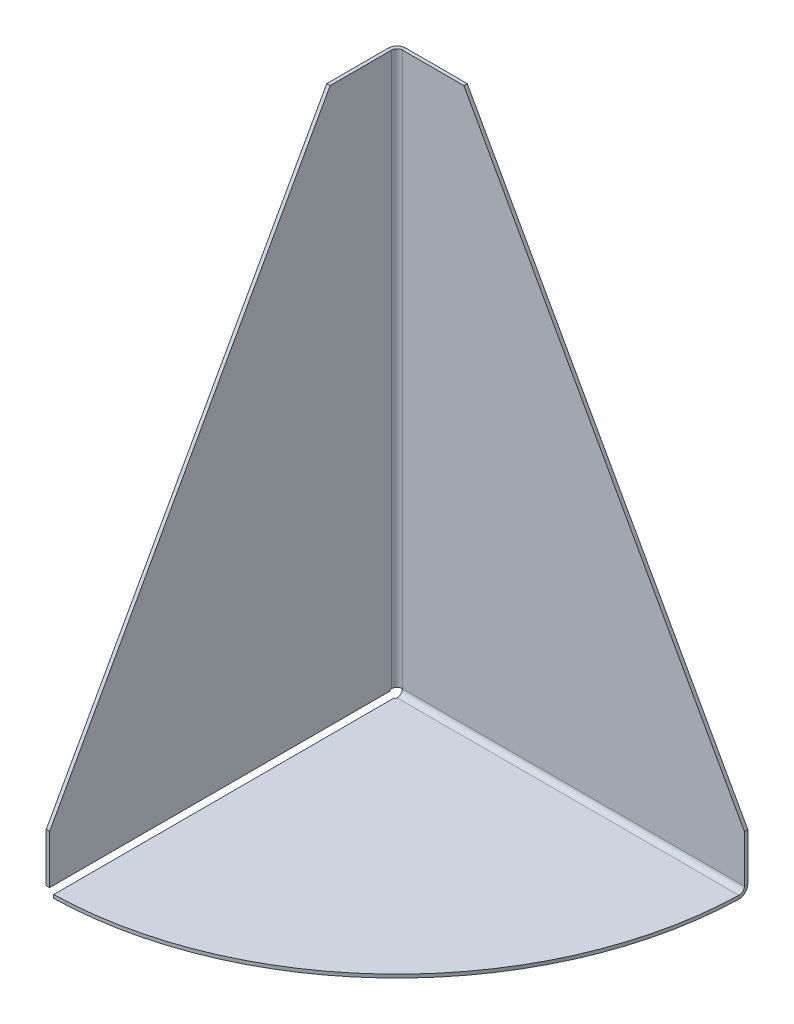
ISO-10303-21;
HEADER;
FILE_DESCRIPTION(('STEP AP214'),'2;1');
FILE_NAME('part.step','',(''),(''),'','','');
FILE_SCHEMA(('AUTOMOTIVE_DESIGN { 1 0 10303 214 1 1 1 1 }'));
ENDSEC;
DATA;
#1=APPLICATION_CONTEXT('core data for automotive mechanical design processes');
#2=APPLICATION_PROTOCOL_DEFINITION('international standard','automotive_design',2000,#1);
#3=PRODUCT_CONTEXT('',#1,'mechanical');
#4=PRODUCT('Part','Part','',(#3));
#5=PRODUCT_RELATED_PRODUCT_CATEGORY('part','',(#4));
#6=PRODUCT_DEFINITION_FORMATION('','',#4);
#7=PRODUCT_DEFINITION_CONTEXT('part definition',#1,'design');
#8=PRODUCT_DEFINITION('design','',#6,#7);
#9=PRODUCT_DEFINITION_SHAPE('','',#8);
#10=(LENGTH_UNIT() NAMED_UNIT(*) SI_UNIT(.MILLI.,.METRE.));
#11=(NAMED_UNIT(*) PLANE_ANGLE_UNIT() SI_UNIT($,.RADIAN.));
#12=(NAMED_UNIT(*) SI_UNIT($,.STERADIAN.) SOLID_ANGLE_UNIT());
#13=UNCERTAINTY_MEASURE_WITH_UNIT(LENGTH_MEASURE(1.E-05),#10,'distance_accuracy_value','');
#14=(GEOMETRIC_REPRESENTATION_CONTEXT(3) GLOBAL_UNCERTAINTY_ASSIGNED_CONTEXT((#13)) GLOBAL_UNIT_ASSIGNED_CONTEXT((#10,
#11,#12)) REPRESENTATION_CONTEXT('',''));
#15=CARTESIAN_POINT('',(0.,0.,0.));
#16=DIRECTION('',(0.,0.,1.));
#17=DIRECTION('',(1.,0.,0.));
#18=AXIS2_PLACEMENT_3D('',#15,#16,#17);
#19=CARTESIAN_POINT('',(3.11911999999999,3.11911999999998,3.11912));
#20=DIRECTION('',(0.,-1.,0.));
#21=DIRECTION('',(0.,0.,-1.));
#22=AXIS2_PLACEMENT_3D('',#19,#20,#21);
#23=PLANE('',#22);
#24=DIRECTION('',(0.,0.,-1.));
#25=VECTOR('',#24,1.);
#26=CARTESIAN_POINT('',(3.11911999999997,3.11911999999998,0.));
#27=LINE('',#26,#25);
#28=CARTESIAN_POINT('',(3.11911999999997,3.11911999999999,1.21412));
#29=VERTEX_POINT('',#28);
#30=CARTESIAN_POINT('',(3.11911999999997,3.11911999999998,0.));
#31=VERTEX_POINT('',#30);
#32=EDGE_CURVE('E11',#29,#31,#27,.T.);
#33=ORIENTED_EDGE('',*,*,#32,.F.);
#34=CARTESIAN_POINT('',(3.11911999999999,3.11911999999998,3.11912));
#35=DIRECTION('',(0.,1.,0.));
#36=DIRECTION('',(0.,0.,1.));
#37=AXIS2_PLACEMENT_3D('',#34,#35,#36);
#38=CIRCLE('',#37,1.905);
#39=CARTESIAN_POINT('',(1.21411999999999,3.11911999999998,3.11911999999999));
#40=VERTEX_POINT('',#39);
#41=EDGE_CURVE('E113',#29,#40,#38,.T.);
#42=ORIENTED_EDGE('',*,*,#41,.T.);
#43=DIRECTION('',(-1.,0.,0.));
#44=VECTOR('',#43,1.);
#45=CARTESIAN_POINT('',(0.,3.11911999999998,3.11911999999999));
#46=LINE('',#45,#44);
#47=CARTESIAN_POINT('',(0.,3.11911999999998,3.11911999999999));
#48=VERTEX_POINT('',#47);
#49=EDGE_CURVE('E46',#40,#48,#46,.T.);
#50=ORIENTED_EDGE('',*,*,#49,.T.);
#51=CARTESIAN_POINT('',(3.11911999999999,3.11911999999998,3.11912));
#52=DIRECTION('',(0.,1.,0.));
#53=DIRECTION('',(0.,0.,1.));
#54=AXIS2_PLACEMENT_3D('',#51,#52,#53);
#55=CIRCLE('',#54,3.11912);
#56=EDGE_CURVE('E116',#31,#48,#55,.T.);
#57=ORIENTED_EDGE('',*,*,#56,.F.);
#58=EDGE_LOOP('',(#33,#42,#50,#57));
#59=FACE_BOUND('',#58,.T.);
#60=ADVANCED_FACE('F36',(#59),#23,.T.);
#61=CARTESIAN_POINT('',(0.,3.11911999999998,0.));
#62=DIRECTION('',(0.,1.,0.));
#63=DIRECTION('',(0.,0.,1.));
#64=AXIS2_PLACEMENT_3D('',#61,#62,#63);
#65=PLANE('',#64);
#66=ORIENTED_EDGE('',*,*,#49,.F.);
#67=DIRECTION('',(0.,0.,-1.));
#68=VECTOR('',#67,1.);
#69=CARTESIAN_POINT('',(1.21412,3.11911999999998,0.));
#70=LINE('',#69,#68);
#71=CARTESIAN_POINT('',(1.21411999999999,3.11911999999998,3.716490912));
#72=VERTEX_POINT('',#71);
#73=EDGE_CURVE('E257',#40,#72,#70,.F.);
#74=ORIENTED_EDGE('',*,*,#73,.T.);
#75=DIRECTION('',(-1.,0.,0.));
#76=VECTOR('',#75,1.);
#77=CARTESIAN_POINT('',(0.,3.11911999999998,3.716490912));
#78=LINE('',#77,#76);
#79=CARTESIAN_POINT('',(0.,3.11911999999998,3.716490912));
#80=VERTEX_POINT('',#79);
#81=EDGE_CURVE('E390',#72,#80,#78,.T.);
#82=ORIENTED_EDGE('',*,*,#81,.T.);
#83=DIRECTION('',(0.,0.,1.));
#84=VECTOR('',#83,1.);
#85=CARTESIAN_POINT('',(0.,3.11911999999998,0.));
#86=LINE('',#85,#84);
#87=EDGE_CURVE('E402',#48,#80,#86,.T.);
#88=ORIENTED_EDGE('',*,*,#87,.F.);
#89=EDGE_LOOP('',(#66,#74,#82,#88));
#90=FACE_BOUND('',#89,.T.);
#91=ADVANCED_FACE('F403',(#90),#65,.F.);
#92=CARTESIAN_POINT('',(0.,0.,3.716490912));
#93=DIRECTION('',(0.,0.,-1.));
#94=DIRECTION('',(0.,1.,0.));
#95=AXIS2_PLACEMENT_3D('',#92,#93,#94);
#96=PLANE('',#95);
#97=ORIENTED_EDGE('',*,*,#81,.F.);
#98=DIRECTION('',(0.,1.,0.));
#99=VECTOR('',#98,1.);
#100=CARTESIAN_POINT('',(1.21411999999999,0.,3.716490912));
#101=LINE('',#100,#99);
#102=CARTESIAN_POINT('',(1.21411999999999,2.6283335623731,3.716490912));
#103=VERTEX_POINT('',#102);
#104=EDGE_CURVE('E255',#103,#72,#101,.T.);
#105=ORIENTED_EDGE('',*,*,#104,.F.);
#106=DIRECTION('',(-1.,0.,0.));
#107=VECTOR('',#106,1.);
#108=CARTESIAN_POINT('',(0.,2.6283335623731,3.716490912));
#109=LINE('',#108,#107);
#110=CARTESIAN_POINT('',(0.,2.6283335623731,3.716490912));
#111=VERTEX_POINT('',#110);
#112=EDGE_CURVE('E387',#103,#111,#109,.T.);
#113=ORIENTED_EDGE('',*,*,#112,.T.);
#114=DIRECTION('',(0.,1.,0.));
#115=VECTOR('',#114,1.);
#116=CARTESIAN_POINT('',(0.,0.,3.716490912));
#117=LINE('',#116,#115);
#118=EDGE_CURVE('E408',#111,#80,#117,.T.);
#119=ORIENTED_EDGE('',*,*,#118,.T.);
#120=EDGE_LOOP('',(#97,#105,#113,#119));
#121=FACE_BOUND('',#120,.T.);
#122=ADVANCED_FACE('F488',(#121),#96,.T.);
#123=CARTESIAN_POINT('',(0.,2.6283335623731,0.));
#124=DIRECTION('',(0.,1.,0.));
#125=DIRECTION('',(0.,0.,1.));
#126=AXIS2_PLACEMENT_3D('',#123,#124,#125);
#127=PLANE('',#126);
#128=ORIENTED_EDGE('',*,*,#112,.F.);
#129=DIRECTION('',(0.,0.,-1.));
#130=VECTOR('',#129,1.);
#131=CARTESIAN_POINT('',(1.21412,2.6283335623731,0.));
#132=LINE('',#131,#130);
#133=CARTESIAN_POINT('',(1.21411999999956,2.6283335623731,124.879785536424));
#134=VERTEX_POINT('',#133);
#135=EDGE_CURVE('E176',#103,#134,#132,.F.);
#136=ORIENTED_EDGE('',*,*,#135,.T.);
#137=DIRECTION('',(-1.,0.,0.));
#138=VECTOR('',#137,1.);
#139=CARTESIAN_POINT('',(-4.36015440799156E-13,2.6283335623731,124.879785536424));
#140=LINE('',#139,#138);
#141=CARTESIAN_POINT('',(-4.36015440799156E-13,2.6283335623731,124.879785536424));
#142=VERTEX_POINT('',#141);
#143=EDGE_CURVE('E384',#134,#142,#140,.T.);
#144=ORIENTED_EDGE('',*,*,#143,.T.);
#145=DIRECTION('',(0.,0.,1.));
#146=VECTOR('',#145,1.);
#147=CARTESIAN_POINT('',(0.,2.6283335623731,0.));
#148=LINE('',#147,#146);
#149=EDGE_CURVE('E187',#111,#142,#148,.T.);
#150=ORIENTED_EDGE('',*,*,#149,.F.);
#151=EDGE_LOOP('',(#128,#136,#144,#150));
#152=FACE_BOUND('',#151,.T.);
#153=ADVANCED_FACE('F493',(#152),#127,.F.);
#154=CARTESIAN_POINT('',(-4.36015440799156E-13,0.,124.879785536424));
#155=DIRECTION('',(0.,0.,-1.));
#156=DIRECTION('',(0.,1.,0.));
#157=AXIS2_PLACEMENT_3D('',#154,#155,#156);
#158=PLANE('',#157);
#159=ORIENTED_EDGE('',*,*,#143,.F.);
#160=DIRECTION('',(0.,1.,0.));
#161=VECTOR('',#160,1.);
#162=CARTESIAN_POINT('',(1.21411999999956,0.,124.879785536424));
#163=LINE('',#162,#161);
#164=CARTESIAN_POINT('',(1.21411999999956,20.,124.879785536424));
#165=VERTEX_POINT('',#164);
#166=EDGE_CURVE('E160',#134,#165,#163,.T.);
#167=ORIENTED_EDGE('',*,*,#166,.T.);
#168=DIRECTION('',(-1.,0.,0.));
#169=VECTOR('',#168,1.);
#170=CARTESIAN_POINT('',(-4.36015440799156E-13,20.,124.879785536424));
#171=LINE('',#170,#169);
#172=CARTESIAN_POINT('',(-4.36015440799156E-13,20.,124.879785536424));
#173=VERTEX_POINT('',#172);
#174=EDGE_CURVE('E381',#165,#173,#171,.T.);
#175=ORIENTED_EDGE('',*,*,#174,.T.);
#176=DIRECTION('',(0.,1.,0.));
#177=VECTOR('',#176,1.);
#178=CARTESIAN_POINT('',(-4.36015440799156E-13,0.,124.879785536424));
#179=LINE('',#178,#177);
#180=EDGE_CURVE('E422',#142,#173,#179,.T.);
#181=ORIENTED_EDGE('',*,*,#180,.F.);
#182=EDGE_LOOP('',(#159,#167,#175,#181));
#183=FACE_BOUND('',#182,.T.);
#184=ADVANCED_FACE('F462',(#183),#158,.F.);
#185=CARTESIAN_POINT('',(0.,200.,25.));
#186=DIRECTION('',(0.,-0.485196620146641,-0.874405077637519));
#187=DIRECTION('',(0.,0.874405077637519,-0.485196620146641));
#188=AXIS2_PLACEMENT_3D('',#185,#186,#187);
#189=PLANE('',#188);
#190=ORIENTED_EDGE('',*,*,#174,.F.);
#191=DIRECTION('',(0.,0.874405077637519,-0.485196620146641));
#192=VECTOR('',#191,1.);
#193=CARTESIAN_POINT('',(1.21411999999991,200.,25.));
#194=LINE('',#193,#192);
#195=CARTESIAN_POINT('',(1.21411999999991,200.,25.));
#196=VERTEX_POINT('',#195);
#197=EDGE_CURVE('E163',#165,#196,#194,.T.);
#198=ORIENTED_EDGE('',*,*,#197,.T.);
#199=DIRECTION('',(-1.,0.,0.));
#200=VECTOR('',#199,1.);
#201=CARTESIAN_POINT('',(0.,200.,25.));
#202=LINE('',#201,#200);
#203=CARTESIAN_POINT('',(0.,200.,25.));
#204=VERTEX_POINT('',#203);
#205=EDGE_CURVE('E378',#196,#204,#202,.T.);
#206=ORIENTED_EDGE('',*,*,#205,.T.);
#207=DIRECTION('',(0.,0.874405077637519,-0.485196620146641));
#208=VECTOR('',#207,1.);
#209=CARTESIAN_POINT('',(0.,200.,25.));
#210=LINE('',#209,#208);
#211=EDGE_CURVE('E424',#173,#204,#210,.T.);
#212=ORIENTED_EDGE('',*,*,#211,.F.);
#213=EDGE_LOOP('',(#190,#198,#206,#212));
#214=FACE_BOUND('',#213,.T.);
#215=ADVANCED_FACE('F466',(#214),#189,.F.);
#216=CARTESIAN_POINT('',(0.,200.,0.));
#217=DIRECTION('',(0.,-1.,0.));
#218=DIRECTION('',(0.,0.,-1.));
#219=AXIS2_PLACEMENT_3D('',#216,#217,#218);
#220=PLANE('',#219);
#221=ORIENTED_EDGE('',*,*,#205,.F.);
#222=DIRECTION('',(0.,0.,-1.));
#223=VECTOR('',#222,1.);
#224=CARTESIAN_POINT('',(1.21412,200.,0.));
#225=LINE('',#224,#223);
#226=CARTESIAN_POINT('',(1.21411999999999,200.,3.11911999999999));
#227=VERTEX_POINT('',#226);
#228=EDGE_CURVE('E246',#196,#227,#225,.T.);
#229=ORIENTED_EDGE('',*,*,#228,.T.);
#230=DIRECTION('',(-1.,0.,0.));
#231=VECTOR('',#230,1.);
#232=CARTESIAN_POINT('',(0.,200.,3.11911999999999));
#233=LINE('',#232,#231);
#234=CARTESIAN_POINT('',(0.,200.,3.11911999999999));
#235=VERTEX_POINT('',#234);
#236=EDGE_CURVE('E376',#227,#235,#233,.T.);
#237=ORIENTED_EDGE('',*,*,#236,.T.);
#238=DIRECTION('',(0.,0.,-1.));
#239=VECTOR('',#238,1.);
#240=CARTESIAN_POINT('',(0.,200.,0.));
#241=LINE('',#240,#239);
#242=EDGE_CURVE('E413',#204,#235,#241,.T.);
#243=ORIENTED_EDGE('',*,*,#242,.F.);
#244=EDGE_LOOP('',(#221,#229,#237,#243));
#245=FACE_BOUND('',#244,.T.);
#246=ADVANCED_FACE('F471',(#245),#220,.F.);
#247=CARTESIAN_POINT('',(3.11911999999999,200.,3.11912));
#248=DIRECTION('',(0.,1.,0.));
#249=DIRECTION('',(0.,0.,1.));
#250=AXIS2_PLACEMENT_3D('',#247,#248,#249);
#251=PLANE('',#250);
#252=ORIENTED_EDGE('',*,*,#236,.F.);
#253=CARTESIAN_POINT('',(3.11911999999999,200.,3.11912));
#254=DIRECTION('',(0.,1.,0.));
#255=DIRECTION('',(0.,0.,1.));
#256=AXIS2_PLACEMENT_3D('',#253,#254,#255);
#257=CIRCLE('',#256,1.905);
#258=CARTESIAN_POINT('',(3.11911999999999,200.,1.21412));
#259=VERTEX_POINT('',#258);
#260=EDGE_CURVE('E155',#227,#259,#257,.F.);
#261=ORIENTED_EDGE('',*,*,#260,.T.);
#262=DIRECTION('',(0.,0.,-1.));
#263=VECTOR('',#262,1.);
#264=CARTESIAN_POINT('',(3.11911999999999,200.,0.));
#265=LINE('',#264,#263);
#266=CARTESIAN_POINT('',(3.11911999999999,200.,0.));
#267=VERTEX_POINT('',#266);
#268=EDGE_CURVE('E54',#259,#267,#265,.T.);
#269=ORIENTED_EDGE('',*,*,#268,.T.);
#270=CARTESIAN_POINT('',(3.11911999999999,200.,3.11912));
#271=DIRECTION('',(0.,-1.,0.));
#272=DIRECTION('',(0.,0.,-1.));
#273=AXIS2_PLACEMENT_3D('',#270,#271,#272);
#274=CIRCLE('',#273,3.11912);
#275=EDGE_CURVE('E399',#235,#267,#274,.T.);
#276=ORIENTED_EDGE('',*,*,#275,.F.);
#277=EDGE_LOOP('',(#252,#261,#269,#276));
#278=FACE_BOUND('',#277,.T.);
#279=ADVANCED_FACE('F472',(#278),#251,.T.);
#280=CARTESIAN_POINT('',(0.,200.,0.));
#281=DIRECTION('',(0.,-1.,0.));
#282=DIRECTION('',(-1.,0.,0.));
#283=AXIS2_PLACEMENT_3D('',#280,#281,#282);
#284=PLANE('',#283);
#285=ORIENTED_EDGE('',*,*,#268,.F.);
#286=DIRECTION('',(-1.,0.,0.));
#287=VECTOR('',#286,1.);
#288=CARTESIAN_POINT('',(0.,200.,1.21412));
#289=LINE('',#288,#287);
#290=CARTESIAN_POINT('',(25.,200.,1.21412));
#291=VERTEX_POINT('',#290);
#292=EDGE_CURVE('E134',#291,#259,#289,.T.);
#293=ORIENTED_EDGE('',*,*,#292,.F.);
#294=DIRECTION('',(0.,0.,-1.));
#295=VECTOR('',#294,1.);
#296=CARTESIAN_POINT('',(25.,200.,0.));
#297=LINE('',#296,#295);
#298=CARTESIAN_POINT('',(25.,200.,0.));
#299=VERTEX_POINT('',#298);
#300=EDGE_CURVE('E372',#291,#299,#297,.T.);
#301=ORIENTED_EDGE('',*,*,#300,.T.);
#302=DIRECTION('',(-1.,0.,0.));
#303=VECTOR('',#302,1.);
#304=CARTESIAN_POINT('',(0.,200.,0.));
#305=LINE('',#304,#303);
#306=EDGE_CURVE('E432',#299,#267,#305,.T.);
#307=ORIENTED_EDGE('',*,*,#306,.T.);
#308=EDGE_LOOP('',(#285,#293,#301,#307));
#309=FACE_BOUND('',#308,.T.);
#310=ADVANCED_FACE('F474',(#309),#284,.F.);
#311=CARTESIAN_POINT('',(25.,200.,0.));
#312=DIRECTION('',(-0.874405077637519,-0.485196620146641,0.));
#313=DIRECTION('',(-0.485196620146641,0.874405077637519,0.));
#314=AXIS2_PLACEMENT_3D('',#311,#312,#313);
#315=PLANE('',#314);
#316=ORIENTED_EDGE('',*,*,#300,.F.);
#317=DIRECTION('',(-0.485196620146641,0.874405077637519,0.));
#318=VECTOR('',#317,1.);
#319=CARTESIAN_POINT('',(25.,200.,1.21412));
#320=LINE('',#319,#318);
#321=CARTESIAN_POINT('',(124.879785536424,20.,1.21412));
#322=VERTEX_POINT('',#321);
#323=EDGE_CURVE('E181',#322,#291,#320,.T.);
#324=ORIENTED_EDGE('',*,*,#323,.F.);
#325=DIRECTION('',(0.,0.,-1.));
#326=VECTOR('',#325,1.);
#327=CARTESIAN_POINT('',(124.879785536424,20.,0.));
#328=LINE('',#327,#326);
#329=CARTESIAN_POINT('',(124.879785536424,20.,0.));
#330=VERTEX_POINT('',#329);
#331=EDGE_CURVE('E358',#322,#330,#328,.T.);
#332=ORIENTED_EDGE('',*,*,#331,.T.);
#333=DIRECTION('',(-0.485196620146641,0.874405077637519,0.));
#334=VECTOR('',#333,1.);
#335=CARTESIAN_POINT('',(25.,200.,0.));
#336=LINE('',#335,#334);
#337=EDGE_CURVE('E434',#330,#299,#336,.T.);
#338=ORIENTED_EDGE('',*,*,#337,.T.);
#339=EDGE_LOOP('',(#316,#324,#332,#338));
#340=FACE_BOUND('',#339,.T.);
#341=ADVANCED_FACE('F480',(#340),#315,.F.);
#342=CARTESIAN_POINT('',(124.879785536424,0.,0.));
#343=DIRECTION('',(-1.,0.,0.));
#344=DIRECTION('',(0.,1.,0.));
#345=AXIS2_PLACEMENT_3D('',#342,#343,#344);
#346=PLANE('',#345);
#347=ORIENTED_EDGE('',*,*,#331,.F.);
#348=DIRECTION('',(0.,1.,0.));
#349=VECTOR('',#348,1.);
#350=CARTESIAN_POINT('',(124.879785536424,0.,1.21412));
#351=LINE('',#350,#349);
#352=CARTESIAN_POINT('',(124.879785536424,3.11912,1.21412));
#353=VERTEX_POINT('',#352);
#354=EDGE_CURVE('E177',#353,#322,#351,.T.);
#355=ORIENTED_EDGE('',*,*,#354,.F.);
#356=CARTESIAN_POINT('',(124.879785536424,3.11912,0.));
#357=CARTESIAN_POINT('',(124.879785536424,3.11912,1.21412));
#358=B_SPLINE_CURVE_WITH_KNOTS('',1,(#356,#357),.UNSPECIFIED.,.F.,.F.,(2,2),(0.,1.),.UNSPECIFIED.);
#359=CARTESIAN_POINT('',(124.879785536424,3.11912,0.));
#360=VERTEX_POINT('',#359);
#361=EDGE_CURVE('E290',#353,#360,#358,.F.);
#362=ORIENTED_EDGE('',*,*,#361,.T.);
#363=DIRECTION('',(0.,1.,0.));
#364=VECTOR('',#363,1.);
#365=CARTESIAN_POINT('',(124.879785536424,0.,0.));
#366=LINE('',#365,#364);
#367=EDGE_CURVE('E188',#360,#330,#366,.T.);
#368=ORIENTED_EDGE('',*,*,#367,.T.);
#369=EDGE_LOOP('',(#347,#355,#362,#368));
#370=FACE_BOUND('',#369,.T.);
#371=ADVANCED_FACE('F325',(#370),#346,.F.);
#372=CARTESIAN_POINT('',(124.840826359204,0.,3.11912));
#373=CARTESIAN_POINT('',(124.84597027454,0.,2.9132380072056));
#374=CARTESIAN_POINT('',(124.850519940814,0.0201868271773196,2.71075566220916));
#375=CARTESIAN_POINT('',(124.856530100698,0.0795192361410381,2.41198038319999));
#376=CARTESIAN_POINT('',(124.858397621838,0.104174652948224,2.31321631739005));
#377=CARTESIAN_POINT('',(124.861872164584,0.163464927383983,2.11738186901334));
#378=CARTESIAN_POINT('',(124.863482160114,0.198268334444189,2.02004202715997));
#379=CARTESIAN_POINT('',(124.867849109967,0.31553992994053,1.73687637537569));
#380=CARTESIAN_POINT('',(124.870183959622,0.411230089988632,1.55779294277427));
#381=CARTESIAN_POINT('',(124.873952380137,0.637314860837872,1.21884286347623));
#382=CARTESIAN_POINT('',(124.875383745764,0.768921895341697,1.0583333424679));
#383=CARTESIAN_POINT('',(124.877490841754,1.0564271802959,0.770594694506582));
#384=CARTESIAN_POINT('',(124.878190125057,1.21330424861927,0.641462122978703));
#385=CARTESIAN_POINT('',(124.879153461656,1.55392691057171,0.413368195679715));
#386=CARTESIAN_POINT('',(124.879409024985,1.73534848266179,0.316387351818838));
#387=CARTESIAN_POINT('',(124.879855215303,2.29788323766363,0.0827772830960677));
#388=CARTESIAN_POINT('',(124.879785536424,2.70876689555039,0.));
#389=CARTESIAN_POINT('',(124.879785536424,3.11912,0.));
#390=CARTESIAN_POINT('',(124.840826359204,1.21412,3.11912));
#391=CARTESIAN_POINT('',(124.845970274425,1.21412,2.99337774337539));
#392=CARTESIAN_POINT('',(124.850519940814,1.22644908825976,2.86971181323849));
#393=CARTESIAN_POINT('',(124.856530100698,1.26268630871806,2.68723505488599));
#394=CARTESIAN_POINT('',(124.858397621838,1.27774458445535,2.62691498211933));
#395=CARTESIAN_POINT('',(124.861872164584,1.31395607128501,2.50730925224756));
#396=CARTESIAN_POINT('',(124.863482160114,1.33521222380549,2.44785902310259));
#397=CARTESIAN_POINT('',(124.867849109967,1.40683575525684,2.27491583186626));
#398=CARTESIAN_POINT('',(124.870183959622,1.46527844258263,2.16554077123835));
#399=CARTESIAN_POINT('',(124.873952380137,1.60335953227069,1.95852728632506));
#400=CARTESIAN_POINT('',(124.875383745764,1.68373842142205,1.8604962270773));
#401=CARTESIAN_POINT('',(124.877490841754,1.859332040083,1.68476008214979));
#402=CARTESIAN_POINT('',(124.878190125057,1.95514458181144,1.60589246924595));
#403=CARTESIAN_POINT('',(124.879153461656,2.16317959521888,1.46658428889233));
#404=CARTESIAN_POINT('',(124.879409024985,2.27398267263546,1.40735331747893));
#405=CARTESIAN_POINT('',(124.879855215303,2.61755031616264,1.26467615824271));
#406=CARTESIAN_POINT('',(124.879785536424,2.86849717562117,1.21412));
#407=CARTESIAN_POINT('',(124.879785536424,3.11912,1.21412));
#408=B_SPLINE_SURFACE_WITH_KNOTS('',1,3,((#372,#373,#374,#375,#376,#377,#378,#379,#380,#381,
#382,#383,#384,#385,#386,#387,#388,#389),(#390,#391,#392,#393,#394,#395,#396,#397,#398,#399,
#400,#401,#402,#403,#404,#405,#406,#407)),.UNSPECIFIED.,.F.,.F.,.F.,(2,2),(4,2,2,2,2,2,2,2,4),
(0.,1.),(0.,0.0006091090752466,0.0009136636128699,0.0012182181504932,0.0018273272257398,
0.0024364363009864,0.003045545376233,0.0036546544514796,0.0048728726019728),.UNSPECIFIED.);
#409=CARTESIAN_POINT('',(124.879785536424,3.11912,1.21412));
#410=CARTESIAN_POINT('',(124.879785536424,2.86849717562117,1.21412));
#411=CARTESIAN_POINT('',(124.879855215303,2.61755031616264,1.26467615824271));
#412=CARTESIAN_POINT('',(124.879409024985,2.27398267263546,1.40735331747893));
#413=CARTESIAN_POINT('',(124.879153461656,2.16317959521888,1.46658428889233));
#414=CARTESIAN_POINT('',(124.878190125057,1.95514458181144,1.60589246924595));
#415=CARTESIAN_POINT('',(124.877490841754,1.859332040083,1.68476008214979));
#416=CARTESIAN_POINT('',(124.875383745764,1.68373842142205,1.8604962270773));
#417=CARTESIAN_POINT('',(124.873952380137,1.60335953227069,1.95852728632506));
#418=CARTESIAN_POINT('',(124.870183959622,1.46527844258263,2.16554077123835));
#419=CARTESIAN_POINT('',(124.867849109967,1.40683575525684,2.27491583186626));
#420=CARTESIAN_POINT('',(124.863482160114,1.33521222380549,2.44785902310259));
#421=CARTESIAN_POINT('',(124.861872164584,1.31395607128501,2.50730925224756));
#422=CARTESIAN_POINT('',(124.858397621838,1.27774458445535,2.62691498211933));
#423=CARTESIAN_POINT('',(124.856530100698,1.26268630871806,2.68723505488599));
#424=CARTESIAN_POINT('',(124.850519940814,1.22644908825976,2.86971181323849));
#425=CARTESIAN_POINT('',(124.845970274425,1.21412,2.99337774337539));
#426=CARTESIAN_POINT('',(124.840826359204,1.21412,3.11912));
#427=B_SPLINE_CURVE_WITH_KNOTS('',3,(#409,#410,#411,#412,#413,#414,#415,#416,#417,#418,#419,
#420,#421,#422,#423,#424,#425,#426),.UNSPECIFIED.,.F.,.F.,(4,2,2,2,2,2,2,2,4),(0.,
0.0012182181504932,0.0018273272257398,0.0024364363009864,0.003045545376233,0.0036546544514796,
0.0039592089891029,0.0042637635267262,0.0048728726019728),.UNSPECIFIED.);
#428=CARTESIAN_POINT('',(124.840826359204,1.21412,3.11912));
#429=VERTEX_POINT('',#428);
#430=EDGE_CURVE('E146',#353,#429,#427,.T.);
#431=CARTESIAN_POINT('',(124.840826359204,1.21412,3.11912));
#432=CARTESIAN_POINT('',(124.840826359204,0.,3.11912));
#433=B_SPLINE_CURVE_WITH_KNOTS('',1,(#431,#432),.UNSPECIFIED.,.F.,.F.,(2,2),(0.,1.),.UNSPECIFIED.);
#434=CARTESIAN_POINT('',(124.840826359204,0.,3.11912));
#435=VERTEX_POINT('',#434);
#436=EDGE_CURVE('E286',#429,#435,#433,.T.);
#437=CARTESIAN_POINT('',(124.840826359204,0.,3.11912));
#438=CARTESIAN_POINT('',(124.84597027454,0.,2.9132380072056));
#439=CARTESIAN_POINT('',(124.850519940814,0.0201868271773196,2.71075566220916));
#440=CARTESIAN_POINT('',(124.856530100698,0.0795192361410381,2.41198038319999));
#441=CARTESIAN_POINT('',(124.858397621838,0.104174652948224,2.31321631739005));
#442=CARTESIAN_POINT('',(124.861872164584,0.163464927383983,2.11738186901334));
#443=CARTESIAN_POINT('',(124.863482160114,0.198268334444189,2.02004202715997));
#444=CARTESIAN_POINT('',(124.867849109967,0.31553992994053,1.73687637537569));
#445=CARTESIAN_POINT('',(124.870183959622,0.411230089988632,1.55779294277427));
#446=CARTESIAN_POINT('',(124.873952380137,0.637314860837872,1.21884286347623));
#447=CARTESIAN_POINT('',(124.875383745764,0.768921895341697,1.0583333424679));
#448=CARTESIAN_POINT('',(124.877490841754,1.0564271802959,0.770594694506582));
#449=CARTESIAN_POINT('',(124.878190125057,1.21330424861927,0.641462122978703));
#450=CARTESIAN_POINT('',(124.879153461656,1.55392691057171,0.413368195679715));
#451=CARTESIAN_POINT('',(124.879409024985,1.73534848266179,0.316387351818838));
#452=CARTESIAN_POINT('',(124.879855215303,2.29788323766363,0.0827772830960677));
#453=CARTESIAN_POINT('',(124.879785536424,2.70876689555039,0.));
#454=CARTESIAN_POINT('',(124.879785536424,3.11912,0.));
#455=B_SPLINE_CURVE_WITH_KNOTS('',3,(#437,#438,#439,#440,#441,#442,#443,#444,#445,#446,#447,
#448,#449,#450,#451,#452,#453,#454),.UNSPECIFIED.,.F.,.F.,(4,2,2,2,2,2,2,2,4),(0.,
0.0006091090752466,0.0009136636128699,0.0012182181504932,0.0018273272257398,0.0024364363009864,
0.003045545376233,0.0036546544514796,0.0048728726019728),.UNSPECIFIED.);
#456=EDGE_CURVE('E205',#360,#435,#455,.F.);
#457=ORIENTED_EDGE('',*,*,#361,.F.);
#458=ORIENTED_EDGE('',*,*,#430,.T.);
#459=ORIENTED_EDGE('',*,*,#436,.T.);
#460=ORIENTED_EDGE('',*,*,#456,.F.);
#461=EDGE_LOOP('',(#457,#458,#459,#460));
#462=FACE_BOUND('',#461,.T.);
#463=ADVANCED_FACE('F313',(#462),#408,.F.);
#464=CARTESIAN_POINT('',(0.,0.,0.));
#465=DIRECTION('',(0.,1.,0.));
#466=DIRECTION('',(0.,0.,1.));
#467=AXIS2_PLACEMENT_3D('',#464,#465,#466);
#468=CYLINDRICAL_SURFACE('',#467,124.879785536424);
#469=ORIENTED_EDGE('',*,*,#436,.F.);
#470=CARTESIAN_POINT('',(0.,1.21412,0.));
#471=DIRECTION('',(0.,1.,0.));
#472=DIRECTION('',(0.,0.,1.));
#473=AXIS2_PLACEMENT_3D('',#470,#471,#472);
#474=CIRCLE('',#473,124.879785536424);
#475=CARTESIAN_POINT('',(2.62833356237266,1.21412,124.852123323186));
#476=VERTEX_POINT('',#475);
#477=EDGE_CURVE('E173',#476,#429,#474,.T.);
#478=ORIENTED_EDGE('',*,*,#477,.F.);
#479=DIRECTION('',(0.,-1.,0.));
#480=VECTOR('',#479,1.);
#481=CARTESIAN_POINT('',(2.62833356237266,0.,124.852123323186));
#482=LINE('',#481,#480);
#483=CARTESIAN_POINT('',(2.62833356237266,0.,124.852123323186));
#484=VERTEX_POINT('',#483);
#485=EDGE_CURVE('E279',#476,#484,#482,.T.);
#486=ORIENTED_EDGE('',*,*,#485,.T.);
#487=CARTESIAN_POINT('',(0.,0.,0.));
#488=DIRECTION('',(0.,1.,0.));
#489=DIRECTION('',(0.,0.,1.));
#490=AXIS2_PLACEMENT_3D('',#487,#488,#489);
#491=CIRCLE('',#490,124.879785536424);
#492=EDGE_CURVE('E184',#484,#435,#491,.T.);
#493=ORIENTED_EDGE('',*,*,#492,.T.);
#494=EDGE_LOOP('',(#469,#478,#486,#493));
#495=FACE_BOUND('',#494,.T.);
#496=ADVANCED_FACE('F282',(#495),#468,.T.);
#497=CARTESIAN_POINT('',(2.6283335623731,0.,0.));
#498=DIRECTION('',(1.,0.,0.));
#499=DIRECTION('',(0.,0.,-1.));
#500=AXIS2_PLACEMENT_3D('',#497,#498,#499);
#501=PLANE('',#500);
#502=ORIENTED_EDGE('',*,*,#485,.F.);
#503=DIRECTION('',(0.,0.,1.));
#504=VECTOR('',#503,1.);
#505=CARTESIAN_POINT('',(2.62833356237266,1.21412,0.));
#506=LINE('',#505,#504);
#507=CARTESIAN_POINT('',(2.62833356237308,1.21412,3.716490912));
#508=VERTEX_POINT('',#507);
#509=EDGE_CURVE('E254',#476,#508,#506,.F.);
#510=ORIENTED_EDGE('',*,*,#509,.T.);
#511=DIRECTION('',(0.,-1.,0.));
#512=VECTOR('',#511,1.);
#513=CARTESIAN_POINT('',(2.62833356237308,0.,3.716490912));
#514=LINE('',#513,#512);
#515=CARTESIAN_POINT('',(2.62833356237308,0.,3.716490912));
#516=VERTEX_POINT('',#515);
#517=EDGE_CURVE('E276',#508,#516,#514,.T.);
#518=ORIENTED_EDGE('',*,*,#517,.T.);
#519=DIRECTION('',(0.,0.,-1.));
#520=VECTOR('',#519,1.);
#521=CARTESIAN_POINT('',(2.6283335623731,0.,0.));
#522=LINE('',#521,#520);
#523=EDGE_CURVE('E438',#484,#516,#522,.T.);
#524=ORIENTED_EDGE('',*,*,#523,.F.);
#525=EDGE_LOOP('',(#502,#510,#518,#524));
#526=FACE_BOUND('',#525,.T.);
#527=ADVANCED_FACE('F273',(#526),#501,.F.);
#528=CARTESIAN_POINT('',(0.,0.,3.716490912));
#529=DIRECTION('',(0.,0.,-1.));
#530=DIRECTION('',(-1.,0.,0.));
#531=AXIS2_PLACEMENT_3D('',#528,#529,#530);
#532=PLANE('',#531);
#533=ORIENTED_EDGE('',*,*,#517,.F.);
#534=DIRECTION('',(1.,0.,0.));
#535=VECTOR('',#534,1.);
#536=CARTESIAN_POINT('',(0.,1.21412,3.716490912));
#537=LINE('',#536,#535);
#538=CARTESIAN_POINT('',(3.11911999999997,1.21412,3.716490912));
#539=VERTEX_POINT('',#538);
#540=EDGE_CURVE('E259',#539,#508,#537,.F.);
#541=ORIENTED_EDGE('',*,*,#540,.F.);
#542=DIRECTION('',(0.,-1.,0.));
#543=VECTOR('',#542,1.);
#544=CARTESIAN_POINT('',(3.11911999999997,0.,3.716490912));
#545=LINE('',#544,#543);
#546=CARTESIAN_POINT('',(3.11911999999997,0.,3.716490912));
#547=VERTEX_POINT('',#546);
#548=EDGE_CURVE('E298',#539,#547,#545,.T.);
#549=ORIENTED_EDGE('',*,*,#548,.T.);
#550=DIRECTION('',(-1.,0.,0.));
#551=VECTOR('',#550,1.);
#552=CARTESIAN_POINT('',(0.,0.,3.716490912));
#553=LINE('',#552,#551);
#554=EDGE_CURVE('E306',#547,#516,#553,.T.);
#555=ORIENTED_EDGE('',*,*,#554,.T.);
#556=EDGE_LOOP('',(#533,#541,#549,#555));
#557=FACE_BOUND('',#556,.T.);
#558=ADVANCED_FACE('F305',(#557),#532,.T.);
#559=CARTESIAN_POINT('',(3.11911999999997,0.,0.));
#560=DIRECTION('',(1.,0.,0.));
#561=DIRECTION('',(0.,0.,-1.));
#562=AXIS2_PLACEMENT_3D('',#559,#560,#561);
#563=PLANE('',#562);
#564=ORIENTED_EDGE('',*,*,#548,.F.);
#565=DIRECTION('',(0.,0.,1.));
#566=VECTOR('',#565,1.);
#567=CARTESIAN_POINT('',(3.11911999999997,1.21412,0.));
#568=LINE('',#567,#566);
#569=CARTESIAN_POINT('',(3.11911999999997,1.21412,3.11912));
#570=VERTEX_POINT('',#569);
#571=EDGE_CURVE('E168',#539,#570,#568,.F.);
#572=ORIENTED_EDGE('',*,*,#571,.T.);
#573=DIRECTION('',(0.,-1.,0.));
#574=VECTOR('',#573,1.);
#575=CARTESIAN_POINT('',(3.11911999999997,0.,3.11912));
#576=LINE('',#575,#574);
#577=CARTESIAN_POINT('',(3.11911999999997,0.,3.11912));
#578=VERTEX_POINT('',#577);
#579=EDGE_CURVE('E40',#570,#578,#576,.T.);
#580=ORIENTED_EDGE('',*,*,#579,.T.);
#581=DIRECTION('',(0.,0.,-1.));
#582=VECTOR('',#581,1.);
#583=CARTESIAN_POINT('',(3.11911999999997,0.,0.));
#584=LINE('',#583,#582);
#585=EDGE_CURVE('E195',#547,#578,#584,.T.);
#586=ORIENTED_EDGE('',*,*,#585,.F.);
#587=EDGE_LOOP('',(#564,#572,#580,#586));
#588=FACE_BOUND('',#587,.T.);
#589=ADVANCED_FACE('F294',(#588),#563,.F.);
#590=CARTESIAN_POINT('',(3.11911999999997,3.11912,3.11912));
#591=DIRECTION('',(-1.,0.,0.));
#592=DIRECTION('',(0.,0.,1.));
#593=AXIS2_PLACEMENT_3D('',#590,#591,#592);
#594=PLANE('',#593);
#595=CARTESIAN_POINT('',(3.11911999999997,3.11912,3.11912));
#596=DIRECTION('',(-1.,0.,0.));
#597=DIRECTION('',(0.,0.,1.));
#598=AXIS2_PLACEMENT_3D('',#595,#596,#597);
#599=CIRCLE('',#598,1.905);
#600=EDGE_CURVE('E143',#570,#29,#599,.F.);
#601=ORIENTED_EDGE('',*,*,#600,.T.);
#602=ORIENTED_EDGE('',*,*,#32,.T.);
#603=CARTESIAN_POINT('',(3.11911999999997,3.11912,3.11912));
#604=DIRECTION('',(1.,0.,0.));
#605=DIRECTION('',(0.,0.,-1.));
#606=AXIS2_PLACEMENT_3D('',#603,#604,#605);
#607=CIRCLE('',#606,3.11912);
#608=EDGE_CURVE('E418',#578,#31,#607,.T.);
#609=ORIENTED_EDGE('',*,*,#608,.F.);
#610=ORIENTED_EDGE('',*,*,#579,.F.);
#611=EDGE_LOOP('',(#601,#602,#609,#610));
#612=FACE_BOUND('',#611,.T.);
#613=ADVANCED_FACE('F38',(#612),#594,.T.);
#614=CARTESIAN_POINT('',(0.,0.,0.));
#615=DIRECTION('',(0.,1.,0.));
#616=DIRECTION('',(0.,0.,1.));
#617=AXIS2_PLACEMENT_3D('',#614,#615,#616);
#618=PLANE('',#617);
#619=ORIENTED_EDGE('',*,*,#585,.T.);
#620=DIRECTION('',(1.,0.,0.));
#621=VECTOR('',#620,1.);
#622=CARTESIAN_POINT('',(124.879785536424,0.,3.11912));
#623=LINE('',#622,#621);
#624=EDGE_CURVE('E191',#578,#435,#623,.T.);
#625=ORIENTED_EDGE('',*,*,#624,.T.);
#626=ORIENTED_EDGE('',*,*,#492,.F.);
#627=ORIENTED_EDGE('',*,*,#523,.T.);
#628=ORIENTED_EDGE('',*,*,#554,.F.);
#629=EDGE_LOOP('',(#619,#625,#626,#627,#628));
#630=FACE_BOUND('',#629,.T.);
#631=ADVANCED_FACE('F223',(#630),#618,.F.);
#632=CARTESIAN_POINT('',(0.,0.,0.));
#633=DIRECTION('',(0.,0.,-1.));
#634=DIRECTION('',(-1.,0.,0.));
#635=AXIS2_PLACEMENT_3D('',#632,#633,#634);
#636=PLANE('',#635);
#637=DIRECTION('',(1.,0.,0.));
#638=VECTOR('',#637,1.);
#639=CARTESIAN_POINT('',(3.11911999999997,3.11912,0.));
#640=LINE('',#639,#638);
#641=EDGE_CURVE('E194',#360,#31,#640,.F.);
#642=ORIENTED_EDGE('',*,*,#641,.T.);
#643=DIRECTION('',(0.,-1.,0.));
#644=VECTOR('',#643,1.);
#645=CARTESIAN_POINT('',(3.11911999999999,200.,0.));
#646=LINE('',#645,#644);
#647=EDGE_CURVE('E398',#31,#267,#646,.F.);
#648=ORIENTED_EDGE('',*,*,#647,.T.);
#649=ORIENTED_EDGE('',*,*,#306,.F.);
#650=ORIENTED_EDGE('',*,*,#337,.F.);
#651=ORIENTED_EDGE('',*,*,#367,.F.);
#652=EDGE_LOOP('',(#642,#648,#649,#650,#651));
#653=FACE_BOUND('',#652,.T.);
#654=ADVANCED_FACE('F600',(#653),#636,.T.);
#655=CARTESIAN_POINT('',(0.,0.,0.));
#656=DIRECTION('',(1.,0.,0.));
#657=DIRECTION('',(0.,0.,-1.));
#658=AXIS2_PLACEMENT_3D('',#655,#656,#657);
#659=PLANE('',#658);
#660=ORIENTED_EDGE('',*,*,#242,.T.);
#661=DIRECTION('',(0.,-1.,0.));
#662=VECTOR('',#661,1.);
#663=CARTESIAN_POINT('',(0.,3.11911999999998,3.11911999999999));
#664=LINE('',#663,#662);
#665=EDGE_CURVE('E396',#235,#48,#664,.T.);
#666=ORIENTED_EDGE('',*,*,#665,.T.);
#667=ORIENTED_EDGE('',*,*,#87,.T.);
#668=ORIENTED_EDGE('',*,*,#118,.F.);
#669=ORIENTED_EDGE('',*,*,#149,.T.);
#670=ORIENTED_EDGE('',*,*,#180,.T.);
#671=ORIENTED_EDGE('',*,*,#211,.T.);
#672=EDGE_LOOP('',(#660,#666,#667,#668,#669,#670,#671));
#673=FACE_BOUND('',#672,.T.);
#674=ADVANCED_FACE('F222',(#673),#659,.F.);
#675=CARTESIAN_POINT('',(0.,3.11912,3.11912));
#676=DIRECTION('',(-1.,0.,0.));
#677=DIRECTION('',(0.,0.,1.));
#678=AXIS2_PLACEMENT_3D('',#675,#676,#677);
#679=CYLINDRICAL_SURFACE('',#678,3.11912);
#680=ORIENTED_EDGE('',*,*,#608,.T.);
#681=ORIENTED_EDGE('',*,*,#641,.F.);
#682=ORIENTED_EDGE('',*,*,#456,.T.);
#683=ORIENTED_EDGE('',*,*,#624,.F.);
#684=EDGE_LOOP('',(#680,#681,#682,#683));
#685=FACE_BOUND('',#684,.T.);
#686=ADVANCED_FACE('F211',(#685),#679,.T.);
#687=CARTESIAN_POINT('',(3.11911999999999,0.,3.11912));
#688=DIRECTION('',(0.,1.,0.));
#689=DIRECTION('',(0.,0.,1.));
#690=AXIS2_PLACEMENT_3D('',#687,#688,#689);
#691=CYLINDRICAL_SURFACE('',#690,3.11912);
#692=ORIENTED_EDGE('',*,*,#275,.T.);
#693=ORIENTED_EDGE('',*,*,#647,.F.);
#694=ORIENTED_EDGE('',*,*,#56,.T.);
#695=ORIENTED_EDGE('',*,*,#665,.F.);
#696=EDGE_LOOP('',(#692,#693,#694,#695));
#697=FACE_BOUND('',#696,.T.);
#698=ADVANCED_FACE('F221',(#697),#691,.T.);
#699=CARTESIAN_POINT('',(0.,1.21412,0.));
#700=DIRECTION('',(0.,1.,0.));
#701=DIRECTION('',(0.,0.,1.));
#702=AXIS2_PLACEMENT_3D('',#699,#700,#701);
#703=PLANE('',#702);
#704=ORIENTED_EDGE('',*,*,#571,.F.);
#705=ORIENTED_EDGE('',*,*,#540,.T.);
#706=ORIENTED_EDGE('',*,*,#509,.F.);
#707=ORIENTED_EDGE('',*,*,#477,.T.);
#708=DIRECTION('',(1.,0.,0.));
#709=VECTOR('',#708,1.);
#710=CARTESIAN_POINT('',(0.,1.21412,3.11912));
#711=LINE('',#710,#709);
#712=EDGE_CURVE('E149',#570,#429,#711,.T.);
#713=ORIENTED_EDGE('',*,*,#712,.F.);
#714=EDGE_LOOP('',(#704,#705,#706,#707,#713));
#715=FACE_BOUND('',#714,.T.);
#716=ADVANCED_FACE('F227',(#715),#703,.T.);
#717=CARTESIAN_POINT('',(0.,0.,1.21412));
#718=DIRECTION('',(0.,0.,-1.));
#719=DIRECTION('',(-1.,0.,0.));
#720=AXIS2_PLACEMENT_3D('',#717,#718,#719);
#721=PLANE('',#720);
#722=DIRECTION('',(-1.,0.,0.));
#723=VECTOR('',#722,1.);
#724=CARTESIAN_POINT('',(0.,3.11912,1.21412));
#725=LINE('',#724,#723);
#726=EDGE_CURVE('E130',#353,#29,#725,.T.);
#727=ORIENTED_EDGE('',*,*,#726,.F.);
#728=ORIENTED_EDGE('',*,*,#354,.T.);
#729=ORIENTED_EDGE('',*,*,#323,.T.);
#730=ORIENTED_EDGE('',*,*,#292,.T.);
#731=DIRECTION('',(0.,1.,0.));
#732=VECTOR('',#731,1.);
#733=CARTESIAN_POINT('',(3.11911999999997,0.,1.21412));
#734=LINE('',#733,#732);
#735=EDGE_CURVE('E126',#29,#259,#734,.T.);
#736=ORIENTED_EDGE('',*,*,#735,.F.);
#737=EDGE_LOOP('',(#727,#728,#729,#730,#736));
#738=FACE_BOUND('',#737,.T.);
#739=ADVANCED_FACE('F128',(#738),#721,.F.);
#740=CARTESIAN_POINT('',(1.21412,0.,0.));
#741=DIRECTION('',(1.,0.,0.));
#742=DIRECTION('',(0.,0.,-1.));
#743=AXIS2_PLACEMENT_3D('',#740,#741,#742);
#744=PLANE('',#743);
#745=ORIENTED_EDGE('',*,*,#228,.F.);
#746=ORIENTED_EDGE('',*,*,#197,.F.);
#747=ORIENTED_EDGE('',*,*,#166,.F.);
#748=ORIENTED_EDGE('',*,*,#135,.F.);
#749=ORIENTED_EDGE('',*,*,#104,.T.);
#750=ORIENTED_EDGE('',*,*,#73,.F.);
#751=DIRECTION('',(0.,1.,0.));
#752=VECTOR('',#751,1.);
#753=CARTESIAN_POINT('',(1.21411999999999,0.,3.11911999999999));
#754=LINE('',#753,#752);
#755=EDGE_CURVE('E137',#227,#40,#754,.F.);
#756=ORIENTED_EDGE('',*,*,#755,.F.);
#757=EDGE_LOOP('',(#745,#746,#747,#748,#749,#750,#756));
#758=FACE_BOUND('',#757,.T.);
#759=ADVANCED_FACE('F232',(#758),#744,.T.);
#760=CARTESIAN_POINT('',(0.,3.11912,3.11912));
#761=DIRECTION('',(-1.,0.,0.));
#762=DIRECTION('',(0.,0.,1.));
#763=AXIS2_PLACEMENT_3D('',#760,#761,#762);
#764=CYLINDRICAL_SURFACE('',#763,1.905);
#765=ORIENTED_EDGE('',*,*,#600,.F.);
#766=ORIENTED_EDGE('',*,*,#712,.T.);
#767=ORIENTED_EDGE('',*,*,#430,.F.);
#768=ORIENTED_EDGE('',*,*,#726,.T.);
#769=EDGE_LOOP('',(#765,#766,#767,#768));
#770=FACE_BOUND('',#769,.T.);
#771=ADVANCED_FACE('F141',(#770),#764,.F.);
#772=CARTESIAN_POINT('',(3.11911999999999,0.,3.11912));
#773=DIRECTION('',(0.,1.,0.));
#774=DIRECTION('',(0.,0.,1.));
#775=AXIS2_PLACEMENT_3D('',#772,#773,#774);
#776=CYLINDRICAL_SURFACE('',#775,1.905);
#777=ORIENTED_EDGE('',*,*,#260,.F.);
#778=ORIENTED_EDGE('',*,*,#755,.T.);
#779=ORIENTED_EDGE('',*,*,#41,.F.);
#780=ORIENTED_EDGE('',*,*,#735,.T.);
#781=EDGE_LOOP('',(#777,#778,#779,#780));
#782=FACE_BOUND('',#781,.T.);
#783=ADVANCED_FACE('F152',(#782),#776,.F.);
#784=CLOSED_SHELL('',(#60,#91,#122,#153,#184,#215,#246,#279,#310,#341,#371,#463,#496,#527,#558,
#589,#613,#631,#654,#674,#686,#698,#716,#739,#759,#771,#783));
#785=MANIFOLD_SOLID_BREP('B2',#784);
#786=ADVANCED_BREP_SHAPE_REPRESENTATION('',(#18,#785),#14);
#787=SHAPE_DEFINITION_REPRESENTATION(#9,#786);
ENDSEC;
END-ISO-10303-21;
